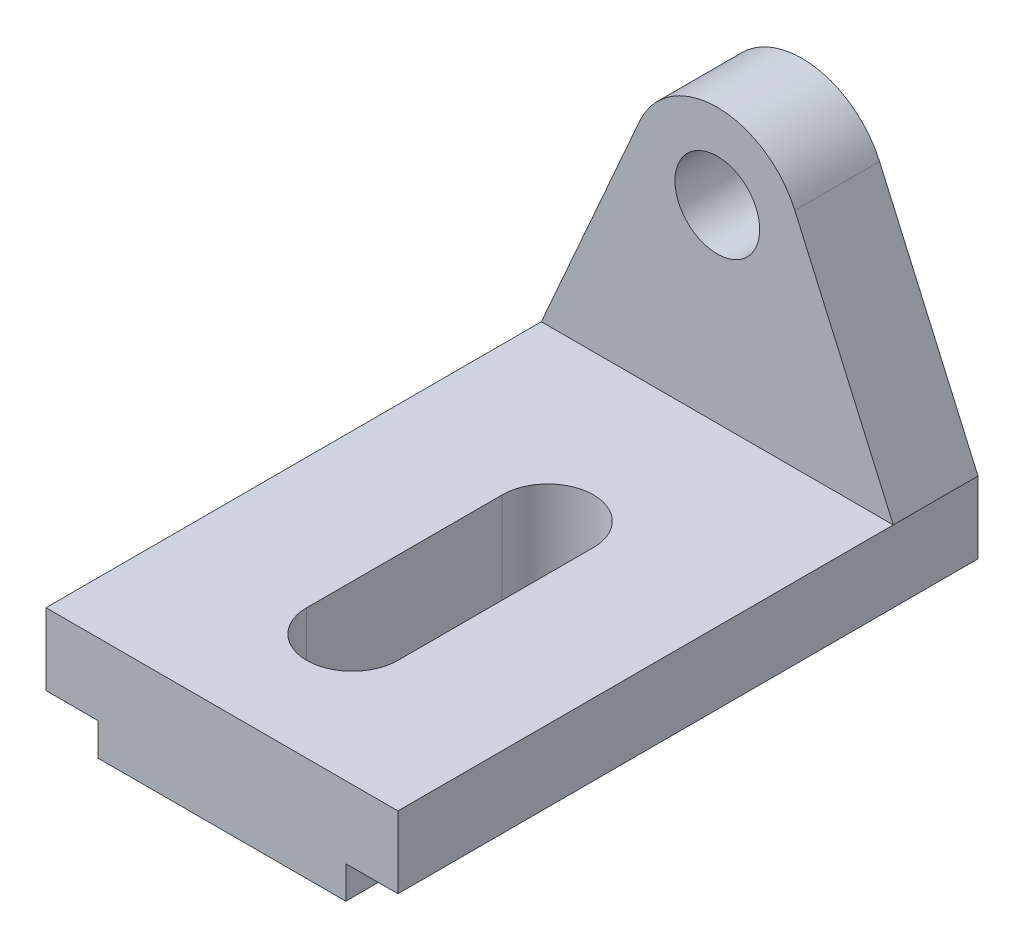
from build123d import *

# Parameters (mm, degrees)
ESBO_O1_W                = 54
ESBO_O1_H                = 16
RESSALTO_EXTRUS_O2_DEPTH = 89
ESBO_O2_W                = 8
ESBO_O2_H                = 4.988802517
CORTE_EXTRUS_O2_DEPTH    = 89
RESSALTO_EXTRUS_O3_DEPTH = 13
CORTE_EXTRUS_O3_DEPTH    = 27


with BuildPart() as part:
    # Esbo_o1 → Ressalto-extrus_o2 (new body)
    with BuildSketch(Plane.XY):
        with Locations((27, -8)):
            Rectangle(ESBO_O1_W, ESBO_O1_H)
    extrude(amount=RESSALTO_EXTRUS_O2_DEPTH)

    # Esbo_o2 → Corte-extrus_o2 (cut)
    with BuildSketch(Plane.XY.offset(89)):
        with Locations((4, -13.505598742)):
            Rectangle(ESBO_O2_W, ESBO_O2_H)
        with Locations((50, -13.505598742)):
            Rectangle(ESBO_O2_W, ESBO_O2_H)
    extrude(amount=-CORTE_EXTRUS_O2_DEPTH, mode=Mode.SUBTRACT)

    # Esbo_o5 → Ressalto-extrus_o3 (add)
    with BuildSketch(Plane(origin=(0, 0, 0), x_dir=(-1, 0, 0), z_dir=(0, 0, -1))):
        with BuildLine():
            Line((-38.894321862, 34.246437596), (-54, 0))
            Line((-54, 0), (-27, 0))
            Line((-27, 0), (0, 0))
            Line((0, 0), (-15.105678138, 34.246437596))
            ThreePointArc((-15.105678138, 34.246437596), (-27, 42), (-38.894321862, 34.246437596))
        make_face()
        with BuildLine():
            ThreePointArc((-20.5, 29), (-22.403805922, 24.403805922), (-27, 22.5))
            ThreePointArc((-27, 22.5), (-31.596194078, 33.596194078), (-20.5, 29))
        make_face(mode=Mode.SUBTRACT)
    extrude(amount=-RESSALTO_EXTRUS_O3_DEPTH)

    # Esbo_o6 → Corte-extrus_o3 (cut)
    with BuildSketch(Plane(origin=(0, 0, 0), x_dir=(1, 0, 0), z_dir=(0, 1, 0))):
        with BuildLine():
            Line((34, -39), (34, -69))
            ThreePointArc((34, -69), (27, -76), (20, -69))
            Line((20, -69), (20, -39))
            ThreePointArc((20, -39), (27, -32), (34, -39))
        make_face()
    extrude(amount=-CORTE_EXTRUS_O3_DEPTH, mode=Mode.SUBTRACT)


solid = part.part
